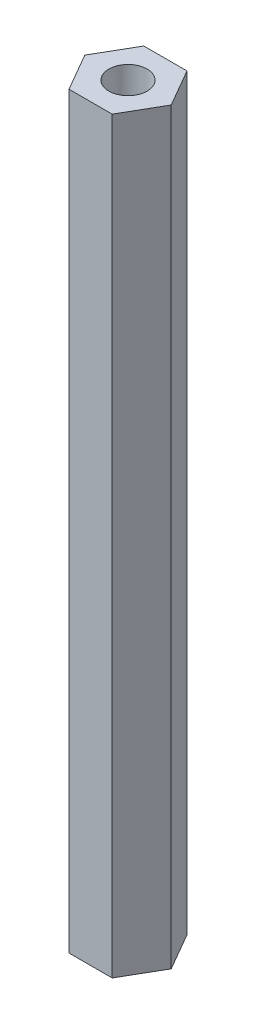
from build123d import *

# Parameters (mm, degrees)
SKETCH1_R           = 1.6256
BOSS_EXTRUDE1_DEPTH = 63.5


with BuildPart() as part:
    # Sketch1 → Boss-Extrude1 (new body)
    with BuildSketch(Plane(origin=(0, 0, 0), x_dir=(1, 0, 0), z_dir=(0, 1, 0))):
        Polygon((1.833087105, 3.175), (-1.833087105, 3.175), (-3.666174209, 0), (-1.833087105, -3.175), (1.833087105, -3.175), (3.666174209, 0), align=None)
        with Locations(Location((0, 0, 0), (0, 0, 270))):
            Circle(SKETCH1_R, mode=Mode.SUBTRACT)
    extrude(amount=BOSS_EXTRUDE1_DEPTH)


solid = part.part
